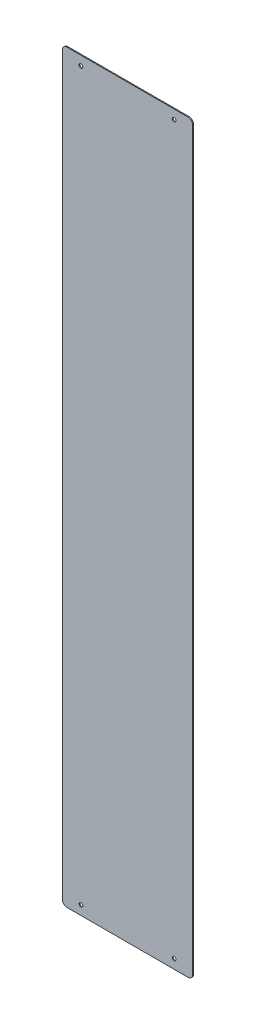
from build123d import *

# Parameters (mm, degrees)
SKETCH1_R           = 2
BOSS_EXTRUDE1_DEPTH = 1


with BuildPart() as part:
    # Sketch1 → Boss-Extrude1 (new body)
    with BuildSketch(Plane.XY):
        with BuildLine():
            Line((65, -400), (-65, -400))
            ThreePointArc((-65, -400), (-68.535533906, -398.535533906), (-70, -395))
            Line((-70, -395), (-70, 395))
            ThreePointArc((-70, 395), (-68.535533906, 398.535533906), (-65, 400))
            Line((-65, 400), (65, 400))
            ThreePointArc((65, 400), (68.535533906, 398.535533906), (70, 395))
            Line((70, 395), (70, -395))
            ThreePointArc((70, -395), (68.535533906, -398.535533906), (65, -400))
        make_face()
        with Locations((-50, 390)):
            Circle(SKETCH1_R, mode=Mode.SUBTRACT)
        with Locations(Location((50, 390, 0), (0, 0, 180))):
            Circle(SKETCH1_R, mode=Mode.SUBTRACT)
        with Locations((50, -390)):
            Circle(SKETCH1_R, mode=Mode.SUBTRACT)
        with Locations(Location((-50, -390, 0), (0, 0, 180))):
            Circle(SKETCH1_R, mode=Mode.SUBTRACT)
    extrude(amount=BOSS_EXTRUDE1_DEPTH)


solid = part.part
